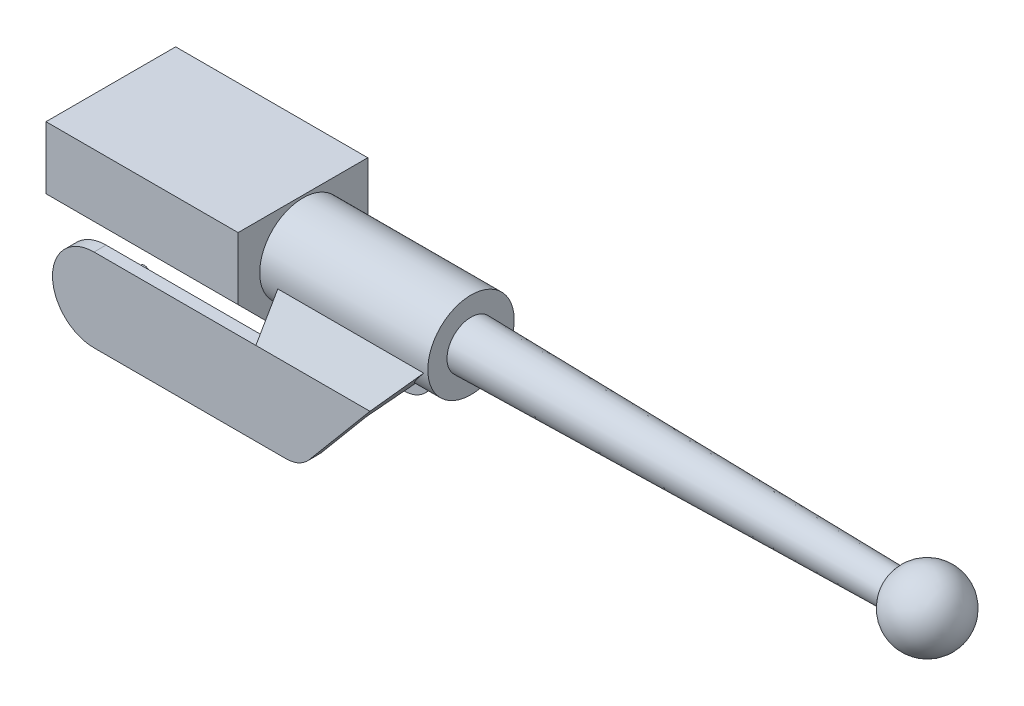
ISO-10303-21;
HEADER;
FILE_DESCRIPTION(('STEP AP214'),'2;1');
FILE_NAME('part.step','',(''),(''),'','','');
FILE_SCHEMA(('AUTOMOTIVE_DESIGN { 1 0 10303 214 1 1 1 1 }'));
ENDSEC;
DATA;
#1=APPLICATION_CONTEXT('core data for automotive mechanical design processes');
#2=APPLICATION_PROTOCOL_DEFINITION('international standard','automotive_design',2000,#1);
#3=PRODUCT_CONTEXT('',#1,'mechanical');
#4=PRODUCT('Part','Part','',(#3));
#5=PRODUCT_RELATED_PRODUCT_CATEGORY('part','',(#4));
#6=PRODUCT_DEFINITION_FORMATION('','',#4);
#7=PRODUCT_DEFINITION_CONTEXT('part definition',#1,'design');
#8=PRODUCT_DEFINITION('design','',#6,#7);
#9=PRODUCT_DEFINITION_SHAPE('','',#8);
#10=(LENGTH_UNIT() NAMED_UNIT(*) SI_UNIT(.MILLI.,.METRE.));
#11=(NAMED_UNIT(*) PLANE_ANGLE_UNIT() SI_UNIT($,.RADIAN.));
#12=(NAMED_UNIT(*) SI_UNIT($,.STERADIAN.) SOLID_ANGLE_UNIT());
#13=UNCERTAINTY_MEASURE_WITH_UNIT(LENGTH_MEASURE(1.E-05),#10,'distance_accuracy_value','');
#14=(GEOMETRIC_REPRESENTATION_CONTEXT(3) GLOBAL_UNCERTAINTY_ASSIGNED_CONTEXT((#13)) GLOBAL_UNIT_ASSIGNED_CONTEXT((#10,
#11,#12)) REPRESENTATION_CONTEXT('',''));
#15=CARTESIAN_POINT('',(0.,0.,0.));
#16=DIRECTION('',(0.,0.,1.));
#17=DIRECTION('',(1.,0.,0.));
#18=AXIS2_PLACEMENT_3D('',#15,#16,#17);
#19=CARTESIAN_POINT('',(-750.,-127.283333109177,110.));
#20=DIRECTION('',(0.,0.,1.));
#21=DIRECTION('',(0.,-1.,0.));
#22=AXIS2_PLACEMENT_3D('',#19,#20,#21);
#23=PLANE('',#22);
#24=CARTESIAN_POINT('',(-250.,-200.,110.));
#25=DIRECTION('',(0.,0.,1.));
#26=DIRECTION('',(0.,-1.,0.));
#27=AXIS2_PLACEMENT_3D('',#24,#25,#26);
#28=CIRCLE('',#27,62.953588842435);
#29=CARTESIAN_POINT('',(-250.,-262.953588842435,110.));
#30=VERTEX_POINT('',#29);
#31=CARTESIAN_POINT('',(-201.774753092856,-240.465786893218,110.));
#32=VERTEX_POINT('',#31);
#33=EDGE_CURVE('E224',#30,#32,#28,.T.);
#34=ORIENTED_EDGE('',*,*,#33,.F.);
#35=DIRECTION('',(-1.,0.,0.));
#36=VECTOR('',#35,1.);
#37=CARTESIAN_POINT('',(-250.,-262.953588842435,110.));
#38=LINE('',#37,#36);
#39=CARTESIAN_POINT('',(-650.,-262.953588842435,110.));
#40=VERTEX_POINT('',#39);
#41=EDGE_CURVE('E212',#30,#40,#38,.T.);
#42=ORIENTED_EDGE('',*,*,#41,.T.);
#43=CARTESIAN_POINT('',(-650.,-176.476794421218,110.));
#44=DIRECTION('',(0.,0.,1.));
#45=DIRECTION('',(0.,-1.,0.));
#46=AXIS2_PLACEMENT_3D('',#43,#44,#45);
#47=CIRCLE('',#46,86.4767944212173);
#48=CARTESIAN_POINT('',(-650.,-90.,110.));
#49=VERTEX_POINT('',#48);
#50=EDGE_CURVE('E366',#40,#49,#47,.F.);
#51=ORIENTED_EDGE('',*,*,#50,.T.);
#52=DIRECTION('',(1.,0.,0.));
#53=VECTOR('',#52,1.);
#54=CARTESIAN_POINT('',(-650.,-90.,110.));
#55=LINE('',#54,#53);
#56=CARTESIAN_POINT('',(-312.953588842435,-90.,110.));
#57=VERTEX_POINT('',#56);
#58=EDGE_CURVE('E195',#49,#57,#55,.T.);
#59=ORIENTED_EDGE('',*,*,#58,.T.);
#60=DIRECTION('',(0.,-1.,0.));
#61=VECTOR('',#60,1.);
#62=CARTESIAN_POINT('',(-312.953588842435,0.,110.));
#63=LINE('',#62,#61);
#64=CARTESIAN_POINT('',(-312.953588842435,-127.283333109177,110.));
#65=VERTEX_POINT('',#64);
#66=EDGE_CURVE('E51',#57,#65,#63,.T.);
#67=ORIENTED_EDGE('',*,*,#66,.T.);
#68=DIRECTION('',(1.,0.,0.));
#69=VECTOR('',#68,1.);
#70=CARTESIAN_POINT('',(-750.,-127.283333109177,110.));
#71=LINE('',#70,#69);
#72=CARTESIAN_POINT('',(-106.803397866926,-127.283333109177,110.));
#73=VERTEX_POINT('',#72);
#74=EDGE_CURVE('E215',#65,#73,#71,.T.);
#75=ORIENTED_EDGE('',*,*,#74,.T.);
#76=DIRECTION('',(0.642787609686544,0.766044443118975,0.));
#77=VECTOR('',#76,1.);
#78=CARTESIAN_POINT('',(-201.774753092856,-240.465786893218,110.));
#79=LINE('',#78,#77);
#80=EDGE_CURVE('E226',#32,#73,#79,.T.);
#81=ORIENTED_EDGE('',*,*,#80,.F.);
#82=EDGE_LOOP('',(#34,#42,#51,#59,#67,#75,#81));
#83=FACE_BOUND('',#82,.T.);
#84=CARTESIAN_POINT('',(-650.,-176.476794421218,110.));
#85=DIRECTION('',(0.,0.,1.));
#86=DIRECTION('',(1.,0.,0.));
#87=AXIS2_PLACEMENT_3D('',#84,#85,#86);
#88=CIRCLE('',#87,10.);
#89=CARTESIAN_POINT('',(-640.,-176.476794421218,110.));
#90=VERTEX_POINT('',#89);
#91=EDGE_CURVE('E372',#90,#90,#88,.T.);
#92=ORIENTED_EDGE('',*,*,#91,.T.);
#93=EDGE_LOOP('',(#92));
#94=FACE_BOUND('',#93,.T.);
#95=CARTESIAN_POINT('',(-250.,-200.,110.));
#96=DIRECTION('',(0.,0.,1.));
#97=DIRECTION('',(0.,-1.,0.));
#98=AXIS2_PLACEMENT_3D('',#95,#96,#97);
#99=CIRCLE('',#98,15.);
#100=CARTESIAN_POINT('',(-250.,-215.,110.));
#101=VERTEX_POINT('',#100);
#102=EDGE_CURVE('E12',#101,#101,#99,.F.);
#103=ORIENTED_EDGE('',*,*,#102,.F.);
#104=EDGE_LOOP('',(#103));
#105=FACE_BOUND('',#104,.T.);
#106=ADVANCED_FACE('F35',(#83,#94,#105),#23,.F.);
#107=CARTESIAN_POINT('',(0.,0.,0.));
#108=DIRECTION('',(1.,0.,0.));
#109=DIRECTION('',(0.,0.,-1.));
#110=AXIS2_PLACEMENT_3D('',#107,#108,#109);
#111=PLANE('',#110);
#112=CARTESIAN_POINT('',(0.,0.,0.));
#113=DIRECTION('',(1.,0.,0.));
#114=DIRECTION('',(0.,0.,-1.));
#115=AXIS2_PLACEMENT_3D('',#112,#113,#114);
#116=CIRCLE('',#115,90.);
#117=CARTESIAN_POINT('',(0.,0.,-90.));
#118=VERTEX_POINT('',#117);
#119=EDGE_CURVE('E310',#118,#118,#116,.T.);
#120=ORIENTED_EDGE('',*,*,#119,.T.);
#121=EDGE_LOOP('',(#120));
#122=FACE_BOUND('',#121,.T.);
#123=CARTESIAN_POINT('',(0.,0.,0.));
#124=DIRECTION('',(1.,0.,0.));
#125=DIRECTION('',(0.,0.,-1.));
#126=AXIS2_PLACEMENT_3D('',#123,#124,#125);
#127=CIRCLE('',#126,50.);
#128=CARTESIAN_POINT('',(0.,0.,-50.));
#129=VERTEX_POINT('',#128);
#130=EDGE_CURVE('E188',#129,#129,#127,.T.);
#131=ORIENTED_EDGE('',*,*,#130,.F.);
#132=EDGE_LOOP('',(#131));
#133=FACE_BOUND('',#132,.T.);
#134=ADVANCED_FACE('F398',(#122,#133),#111,.T.);
#135=CARTESIAN_POINT('',(-350.,0.,0.));
#136=DIRECTION('',(1.,0.,0.));
#137=DIRECTION('',(0.,0.,-1.));
#138=AXIS2_PLACEMENT_3D('',#135,#136,#137);
#139=CYLINDRICAL_SURFACE('',#138,90.);
#140=DIRECTION('',(1.,0.,0.));
#141=VECTOR('',#140,1.);
#142=CARTESIAN_POINT('',(-350.,-10.9084534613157,89.3364743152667));
#143=LINE('',#142,#141);
#144=CARTESIAN_POINT('',(-9.15327927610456,-10.9084534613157,89.3364743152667));
#145=VERTEX_POINT('',#144);
#146=CARTESIAN_POINT('',(-312.953588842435,-10.9084534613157,89.3364743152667));
#147=VERTEX_POINT('',#146);
#148=EDGE_CURVE('E273',#145,#147,#143,.F.);
#149=ORIENTED_EDGE('',*,*,#148,.F.);
#150=CARTESIAN_POINT('',(0.,0.,0.));
#151=DIRECTION('',(-0.766044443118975,0.642787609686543,0.));
#152=DIRECTION('',(0.642787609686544,0.766044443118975,0.));
#153=AXIS2_PLACEMENT_3D('',#150,#151,#152);
#154=ELLIPSE('',#153,117.486656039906,90.);
#155=CARTESIAN_POINT('',(-60.1565780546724,-71.6918180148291,54.4084849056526));
#156=VERTEX_POINT('',#155);
#157=EDGE_CURVE('E280',#145,#156,#154,.F.);
#158=ORIENTED_EDGE('',*,*,#157,.T.);
#159=DIRECTION('',(1.,0.,0.));
#160=VECTOR('',#159,1.);
#161=CARTESIAN_POINT('',(-350.,-71.6918180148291,54.4084849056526));
#162=LINE('',#161,#160);
#163=CARTESIAN_POINT('',(-312.953588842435,-71.6918180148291,54.4084849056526));
#164=VERTEX_POINT('',#163);
#165=EDGE_CURVE('E337',#156,#164,#162,.F.);
#166=ORIENTED_EDGE('',*,*,#165,.T.);
#167=CARTESIAN_POINT('',(-312.953588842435,0.,0.));
#168=DIRECTION('',(1.,0.,0.));
#169=DIRECTION('',(0.,0.,-1.));
#170=AXIS2_PLACEMENT_3D('',#167,#168,#169);
#171=CIRCLE('',#170,90.);
#172=EDGE_CURVE('E44',#164,#147,#171,.F.);
#173=ORIENTED_EDGE('',*,*,#172,.T.);
#174=EDGE_LOOP('',(#149,#158,#166,#173));
#175=FACE_BOUND('',#174,.T.);
#176=DIRECTION('',(1.,0.,0.));
#177=VECTOR('',#176,1.);
#178=CARTESIAN_POINT('',(-350.,-10.9084534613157,-89.3364743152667));
#179=LINE('',#178,#177);
#180=CARTESIAN_POINT('',(-312.953588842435,-10.9084534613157,-89.3364743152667));
#181=VERTEX_POINT('',#180);
#182=CARTESIAN_POINT('',(-9.15327927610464,-10.9084534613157,-89.3364743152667));
#183=VERTEX_POINT('',#182);
#184=EDGE_CURVE('E275',#181,#183,#179,.T.);
#185=ORIENTED_EDGE('',*,*,#184,.F.);
#186=CARTESIAN_POINT('',(-312.953588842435,-74.3017038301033,-50.7863840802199));
#187=VERTEX_POINT('',#186);
#188=EDGE_CURVE('E334',#181,#187,#171,.F.);
#189=ORIENTED_EDGE('',*,*,#188,.T.);
#190=DIRECTION('',(1.,0.,0.));
#191=VECTOR('',#190,1.);
#192=CARTESIAN_POINT('',(-350.,-74.3017038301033,-50.7863840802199));
#193=LINE('',#192,#191);
#194=CARTESIAN_POINT('',(-62.3465322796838,-74.3017038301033,-50.7863840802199));
#195=VERTEX_POINT('',#194);
#196=EDGE_CURVE('E331',#187,#195,#193,.T.);
#197=ORIENTED_EDGE('',*,*,#196,.T.);
#198=EDGE_CURVE('E277',#195,#183,#154,.F.);
#199=ORIENTED_EDGE('',*,*,#198,.T.);
#200=EDGE_LOOP('',(#185,#189,#197,#199));
#201=FACE_BOUND('',#200,.T.);
#202=CARTESIAN_POINT('',(-350.,0.,0.));
#203=DIRECTION('',(1.,0.,0.));
#204=DIRECTION('',(0.,0.,-1.));
#205=AXIS2_PLACEMENT_3D('',#202,#203,#204);
#206=CIRCLE('',#205,90.);
#207=CARTESIAN_POINT('',(-350.,0.,-90.));
#208=VERTEX_POINT('',#207);
#209=EDGE_CURVE('E307',#208,#208,#206,.F.);
#210=ORIENTED_EDGE('',*,*,#209,.F.);
#211=EDGE_LOOP('',(#210));
#212=FACE_BOUND('',#211,.T.);
#213=ORIENTED_EDGE('',*,*,#119,.F.);
#214=EDGE_LOOP('',(#213));
#215=FACE_BOUND('',#214,.T.);
#216=ADVANCED_FACE('F344',(#175,#201,#212,#215),#139,.T.);
#217=CARTESIAN_POINT('',(-750.,-95.,135.));
#218=DIRECTION('',(0.,0.,-1.));
#219=DIRECTION('',(-1.,0.,0.));
#220=AXIS2_PLACEMENT_3D('',#217,#218,#219);
#221=PLANE('',#220);
#222=DIRECTION('',(0.,1.,0.));
#223=VECTOR('',#222,1.);
#224=CARTESIAN_POINT('',(-750.,-95.,135.));
#225=LINE('',#224,#223);
#226=CARTESIAN_POINT('',(-750.,-35.,135.));
#227=VERTEX_POINT('',#226);
#228=CARTESIAN_POINT('',(-750.,95.,135.));
#229=VERTEX_POINT('',#228);
#230=EDGE_CURVE('E281',#227,#229,#225,.T.);
#231=ORIENTED_EDGE('',*,*,#230,.F.);
#232=DIRECTION('',(1.,0.,0.));
#233=VECTOR('',#232,1.);
#234=CARTESIAN_POINT('',(-750.,-35.,135.));
#235=LINE('',#234,#233);
#236=CARTESIAN_POINT('',(-350.,-35.,135.));
#237=VERTEX_POINT('',#236);
#238=EDGE_CURVE('E328',#227,#237,#235,.T.);
#239=ORIENTED_EDGE('',*,*,#238,.T.);
#240=DIRECTION('',(0.,1.,0.));
#241=VECTOR('',#240,1.);
#242=CARTESIAN_POINT('',(-350.,-95.,135.));
#243=LINE('',#242,#241);
#244=CARTESIAN_POINT('',(-350.,95.,135.));
#245=VERTEX_POINT('',#244);
#246=EDGE_CURVE('E293',#237,#245,#243,.T.);
#247=ORIENTED_EDGE('',*,*,#246,.T.);
#248=DIRECTION('',(1.,0.,0.));
#249=VECTOR('',#248,1.);
#250=CARTESIAN_POINT('',(-750.,95.,135.));
#251=LINE('',#250,#249);
#252=EDGE_CURVE('E304',#229,#245,#251,.T.);
#253=ORIENTED_EDGE('',*,*,#252,.F.);
#254=EDGE_LOOP('',(#231,#239,#247,#253));
#255=FACE_BOUND('',#254,.T.);
#256=ADVANCED_FACE('F461',(#255),#221,.F.);
#257=CARTESIAN_POINT('',(-750.,95.,-135.));
#258=DIRECTION('',(0.,-1.,0.));
#259=DIRECTION('',(0.,0.,-1.));
#260=AXIS2_PLACEMENT_3D('',#257,#258,#259);
#261=PLANE('',#260);
#262=DIRECTION('',(0.,0.,-1.));
#263=VECTOR('',#262,1.);
#264=CARTESIAN_POINT('',(-350.,95.,-135.));
#265=LINE('',#264,#263);
#266=CARTESIAN_POINT('',(-350.,95.,-135.));
#267=VERTEX_POINT('',#266);
#268=EDGE_CURVE('E295',#245,#267,#265,.T.);
#269=ORIENTED_EDGE('',*,*,#268,.T.);
#270=DIRECTION('',(1.,0.,0.));
#271=VECTOR('',#270,1.);
#272=CARTESIAN_POINT('',(-750.,95.,-135.));
#273=LINE('',#272,#271);
#274=CARTESIAN_POINT('',(-750.,95.,-135.));
#275=VERTEX_POINT('',#274);
#276=EDGE_CURVE('E292',#275,#267,#273,.T.);
#277=ORIENTED_EDGE('',*,*,#276,.F.);
#278=DIRECTION('',(0.,0.,-1.));
#279=VECTOR('',#278,1.);
#280=CARTESIAN_POINT('',(-750.,95.,-135.));
#281=LINE('',#280,#279);
#282=EDGE_CURVE('E283',#229,#275,#281,.T.);
#283=ORIENTED_EDGE('',*,*,#282,.F.);
#284=ORIENTED_EDGE('',*,*,#252,.T.);
#285=EDGE_LOOP('',(#269,#277,#283,#284));
#286=FACE_BOUND('',#285,.T.);
#287=ADVANCED_FACE('F457',(#286),#261,.F.);
#288=CARTESIAN_POINT('',(-750.,-95.,-135.));
#289=DIRECTION('',(0.,0.,1.));
#290=DIRECTION('',(1.,0.,0.));
#291=AXIS2_PLACEMENT_3D('',#288,#289,#290);
#292=PLANE('',#291);
#293=DIRECTION('',(0.,-1.,0.));
#294=VECTOR('',#293,1.);
#295=CARTESIAN_POINT('',(-350.,-95.,-135.));
#296=LINE('',#295,#294);
#297=CARTESIAN_POINT('',(-350.,-35.,-135.));
#298=VERTEX_POINT('',#297);
#299=EDGE_CURVE('E297',#267,#298,#296,.T.);
#300=ORIENTED_EDGE('',*,*,#299,.T.);
#301=DIRECTION('',(-1.,0.,0.));
#302=VECTOR('',#301,1.);
#303=CARTESIAN_POINT('',(-750.,-35.,-135.));
#304=LINE('',#303,#302);
#305=CARTESIAN_POINT('',(-750.,-35.,-135.));
#306=VERTEX_POINT('',#305);
#307=EDGE_CURVE('E322',#298,#306,#304,.T.);
#308=ORIENTED_EDGE('',*,*,#307,.T.);
#309=DIRECTION('',(0.,-1.,0.));
#310=VECTOR('',#309,1.);
#311=CARTESIAN_POINT('',(-750.,-95.,-135.));
#312=LINE('',#311,#310);
#313=EDGE_CURVE('E286',#275,#306,#312,.T.);
#314=ORIENTED_EDGE('',*,*,#313,.F.);
#315=ORIENTED_EDGE('',*,*,#276,.T.);
#316=EDGE_LOOP('',(#300,#308,#314,#315));
#317=FACE_BOUND('',#316,.T.);
#318=ADVANCED_FACE('F453',(#317),#292,.F.);
#319=CARTESIAN_POINT('',(-750.,-95.,-135.));
#320=DIRECTION('',(0.,1.,0.));
#321=DIRECTION('',(0.,0.,1.));
#322=AXIS2_PLACEMENT_3D('',#319,#320,#321);
#323=PLANE('',#322);
#324=DIRECTION('',(0.,0.,1.));
#325=VECTOR('',#324,1.);
#326=CARTESIAN_POINT('',(-750.,-95.,-135.));
#327=LINE('',#326,#325);
#328=CARTESIAN_POINT('',(-750.,-95.,-75.));
#329=VERTEX_POINT('',#328);
#330=CARTESIAN_POINT('',(-750.,-95.,75.));
#331=VERTEX_POINT('',#330);
#332=EDGE_CURVE('E289',#329,#331,#327,.T.);
#333=ORIENTED_EDGE('',*,*,#332,.F.);
#334=DIRECTION('',(1.,0.,0.));
#335=VECTOR('',#334,1.);
#336=CARTESIAN_POINT('',(-750.,-95.,-75.));
#337=LINE('',#336,#335);
#338=CARTESIAN_POINT('',(-350.,-95.,-75.));
#339=VERTEX_POINT('',#338);
#340=EDGE_CURVE('E315',#329,#339,#337,.T.);
#341=ORIENTED_EDGE('',*,*,#340,.T.);
#342=DIRECTION('',(0.,0.,1.));
#343=VECTOR('',#342,1.);
#344=CARTESIAN_POINT('',(-350.,-95.,-135.));
#345=LINE('',#344,#343);
#346=CARTESIAN_POINT('',(-350.,-95.,75.));
#347=VERTEX_POINT('',#346);
#348=EDGE_CURVE('E284',#339,#347,#345,.T.);
#349=ORIENTED_EDGE('',*,*,#348,.T.);
#350=DIRECTION('',(-1.,0.,0.));
#351=VECTOR('',#350,1.);
#352=CARTESIAN_POINT('',(-750.,-95.,75.));
#353=LINE('',#352,#351);
#354=EDGE_CURVE('E313',#347,#331,#353,.T.);
#355=ORIENTED_EDGE('',*,*,#354,.T.);
#356=EDGE_LOOP('',(#333,#341,#349,#355));
#357=FACE_BOUND('',#356,.T.);
#358=ADVANCED_FACE('F445',(#357),#323,.F.);
#359=CARTESIAN_POINT('',(-750.,95.,135.));
#360=DIRECTION('',(1.,0.,0.));
#361=DIRECTION('',(0.,0.,-1.));
#362=AXIS2_PLACEMENT_3D('',#359,#360,#361);
#363=PLANE('',#362);
#364=ORIENTED_EDGE('',*,*,#313,.T.);
#365=DIRECTION('',(0.,0.707106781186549,-0.707106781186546));
#366=VECTOR('',#365,1.);
#367=CARTESIAN_POINT('',(-750.,-95.,-75.));
#368=LINE('',#367,#366);
#369=EDGE_CURVE('E326',#306,#329,#368,.F.);
#370=ORIENTED_EDGE('',*,*,#369,.T.);
#371=ORIENTED_EDGE('',*,*,#332,.T.);
#372=DIRECTION('',(0.,-0.707106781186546,-0.707106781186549));
#373=VECTOR('',#372,1.);
#374=CARTESIAN_POINT('',(-750.,-35.,135.));
#375=LINE('',#374,#373);
#376=EDGE_CURVE('E324',#331,#227,#375,.F.);
#377=ORIENTED_EDGE('',*,*,#376,.T.);
#378=ORIENTED_EDGE('',*,*,#230,.T.);
#379=ORIENTED_EDGE('',*,*,#282,.T.);
#380=EDGE_LOOP('',(#364,#370,#371,#377,#378,#379));
#381=FACE_BOUND('',#380,.T.);
#382=ADVANCED_FACE('F441',(#381),#363,.F.);
#383=CARTESIAN_POINT('',(-350.,95.,135.));
#384=DIRECTION('',(1.,0.,0.));
#385=DIRECTION('',(0.,0.,-1.));
#386=AXIS2_PLACEMENT_3D('',#383,#384,#385);
#387=PLANE('',#386);
#388=ORIENTED_EDGE('',*,*,#209,.T.);
#389=EDGE_LOOP('',(#388));
#390=FACE_BOUND('',#389,.T.);
#391=ORIENTED_EDGE('',*,*,#348,.F.);
#392=DIRECTION('',(0.,-0.707106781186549,0.707106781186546));
#393=VECTOR('',#392,1.);
#394=CARTESIAN_POINT('',(-350.,-105.,-65.));
#395=LINE('',#394,#393);
#396=EDGE_CURVE('E320',#339,#298,#395,.F.);
#397=ORIENTED_EDGE('',*,*,#396,.T.);
#398=ORIENTED_EDGE('',*,*,#299,.F.);
#399=ORIENTED_EDGE('',*,*,#268,.F.);
#400=ORIENTED_EDGE('',*,*,#246,.F.);
#401=DIRECTION('',(0.,0.707106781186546,0.707106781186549));
#402=VECTOR('',#401,1.);
#403=CARTESIAN_POINT('',(-350.,30.,200.));
#404=LINE('',#403,#402);
#405=EDGE_CURVE('E318',#237,#347,#404,.F.);
#406=ORIENTED_EDGE('',*,*,#405,.T.);
#407=EDGE_LOOP('',(#391,#397,#398,#399,#400,#406));
#408=FACE_BOUND('',#407,.T.);
#409=ADVANCED_FACE('F444',(#390,#408),#387,.T.);
#410=CARTESIAN_POINT('',(-750.,-95.,-75.));
#411=DIRECTION('',(0.,0.707106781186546,0.707106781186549));
#412=DIRECTION('',(0.,-0.707106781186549,0.707106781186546));
#413=AXIS2_PLACEMENT_3D('',#410,#411,#412);
#414=PLANE('',#413);
#415=ORIENTED_EDGE('',*,*,#369,.F.);
#416=ORIENTED_EDGE('',*,*,#307,.F.);
#417=ORIENTED_EDGE('',*,*,#396,.F.);
#418=ORIENTED_EDGE('',*,*,#340,.F.);
#419=EDGE_LOOP('',(#415,#416,#417,#418));
#420=FACE_BOUND('',#419,.T.);
#421=ADVANCED_FACE('F449',(#420),#414,.F.);
#422=CARTESIAN_POINT('',(-750.,-35.,135.));
#423=DIRECTION('',(0.,0.707106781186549,-0.707106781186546));
#424=DIRECTION('',(0.,0.707106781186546,0.707106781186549));
#425=AXIS2_PLACEMENT_3D('',#422,#423,#424);
#426=PLANE('',#425);
#427=ORIENTED_EDGE('',*,*,#376,.F.);
#428=ORIENTED_EDGE('',*,*,#354,.F.);
#429=ORIENTED_EDGE('',*,*,#405,.F.);
#430=ORIENTED_EDGE('',*,*,#238,.F.);
#431=EDGE_LOOP('',(#427,#428,#429,#430));
#432=FACE_BOUND('',#431,.T.);
#433=ADVANCED_FACE('F414',(#432),#426,.F.);
#434=CARTESIAN_POINT('',(-750.,-133.515319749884,-110.));
#435=DIRECTION('',(0.,0.707106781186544,-0.707106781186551));
#436=DIRECTION('',(0.,0.707106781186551,0.707106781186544));
#437=AXIS2_PLACEMENT_3D('',#434,#435,#436);
#438=PLANE('',#437);
#439=ORIENTED_EDGE('',*,*,#196,.F.);
#440=DIRECTION('',(0.,0.707106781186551,0.707106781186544));
#441=VECTOR('',#440,1.);
#442=CARTESIAN_POINT('',(-312.953588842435,55.7423401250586,79.2576598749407));
#443=LINE('',#442,#441);
#444=CARTESIAN_POINT('',(-312.953588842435,-133.515319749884,-110.));
#445=VERTEX_POINT('',#444);
#446=EDGE_CURVE('E265',#445,#187,#443,.T.);
#447=ORIENTED_EDGE('',*,*,#446,.F.);
#448=DIRECTION('',(1.,0.,0.));
#449=VECTOR('',#448,1.);
#450=CARTESIAN_POINT('',(-750.,-133.515319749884,-110.));
#451=LINE('',#450,#449);
#452=CARTESIAN_POINT('',(-112.032655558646,-133.515319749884,-110.));
#453=VERTEX_POINT('',#452);
#454=EDGE_CURVE('E214',#445,#453,#451,.T.);
#455=ORIENTED_EDGE('',*,*,#454,.T.);
#456=DIRECTION('',(-0.510273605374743,-0.608120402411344,-0.608120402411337));
#457=VECTOR('',#456,1.);
#458=CARTESIAN_POINT('',(-92.5617813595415,-110.310835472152,-86.7955157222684));
#459=LINE('',#458,#457);
#460=EDGE_CURVE('E217',#195,#453,#459,.T.);
#461=ORIENTED_EDGE('',*,*,#460,.F.);
#462=EDGE_LOOP('',(#439,#447,#455,#461));
#463=FACE_BOUND('',#462,.T.);
#464=ADVANCED_FACE('F410',(#463),#438,.F.);
#465=CARTESIAN_POINT('',(-750.,-133.515319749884,-110.));
#466=DIRECTION('',(0.,0.,-1.));
#467=DIRECTION('',(0.,1.,0.));
#468=AXIS2_PLACEMENT_3D('',#465,#466,#467);
#469=PLANE('',#468);
#470=CARTESIAN_POINT('',(-250.,-200.,-110.));
#471=DIRECTION('',(0.,0.,-1.));
#472=DIRECTION('',(-1.,0.,0.));
#473=AXIS2_PLACEMENT_3D('',#470,#471,#472);
#474=CIRCLE('',#473,15.);
#475=CARTESIAN_POINT('',(-265.,-200.,-110.));
#476=VERTEX_POINT('',#475);
#477=EDGE_CURVE('E379',#476,#476,#474,.T.);
#478=ORIENTED_EDGE('',*,*,#477,.T.);
#479=EDGE_LOOP('',(#478));
#480=FACE_BOUND('',#479,.T.);
#481=ORIENTED_EDGE('',*,*,#454,.F.);
#482=DIRECTION('',(0.,1.,0.));
#483=VECTOR('',#482,1.);
#484=CARTESIAN_POINT('',(-312.953588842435,0.,-110.));
#485=LINE('',#484,#483);
#486=CARTESIAN_POINT('',(-312.953588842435,-200.,-110.));
#487=VERTEX_POINT('',#486);
#488=EDGE_CURVE('E270',#487,#445,#485,.T.);
#489=ORIENTED_EDGE('',*,*,#488,.F.);
#490=CARTESIAN_POINT('',(-250.,-200.,-110.));
#491=DIRECTION('',(0.,0.,-1.));
#492=DIRECTION('',(0.,1.,0.));
#493=AXIS2_PLACEMENT_3D('',#490,#491,#492);
#494=CIRCLE('',#493,62.953588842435);
#495=CARTESIAN_POINT('',(-201.774753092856,-240.465786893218,-110.));
#496=VERTEX_POINT('',#495);
#497=EDGE_CURVE('E229',#496,#487,#494,.T.);
#498=ORIENTED_EDGE('',*,*,#497,.F.);
#499=DIRECTION('',(-0.642787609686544,-0.766044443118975,0.));
#500=VECTOR('',#499,1.);
#501=CARTESIAN_POINT('',(-201.774753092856,-240.465786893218,-110.));
#502=LINE('',#501,#500);
#503=EDGE_CURVE('E231',#453,#496,#502,.T.);
#504=ORIENTED_EDGE('',*,*,#503,.F.);
#505=EDGE_LOOP('',(#481,#489,#498,#504));
#506=FACE_BOUND('',#505,.T.);
#507=ADVANCED_FACE('F413',(#480,#506),#469,.F.);
#508=CARTESIAN_POINT('',(0.,0.,-83.0384757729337));
#509=DIRECTION('',(0.,-0.5,0.86602540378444));
#510=DIRECTION('',(0.,-0.86602540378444,-0.5));
#511=AXIS2_PLACEMENT_3D('',#508,#509,#510);
#512=PLANE('',#511);
#513=DIRECTION('',(0.,0.86602540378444,0.5));
#514=VECTOR('',#513,1.);
#515=CARTESIAN_POINT('',(-312.953588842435,0.,-83.0384757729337));
#516=LINE('',#515,#514);
#517=CARTESIAN_POINT('',(-312.953588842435,-90.,-135.));
#518=VERTEX_POINT('',#517);
#519=EDGE_CURVE('E255',#181,#518,#516,.F.);
#520=ORIENTED_EDGE('',*,*,#519,.F.);
#521=ORIENTED_EDGE('',*,*,#184,.T.);
#522=DIRECTION('',(-0.58785888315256,-0.700582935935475,-0.404481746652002));
#523=VECTOR('',#522,1.);
#524=CARTESIAN_POINT('',(0.,0.,-83.0384757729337));
#525=LINE('',#524,#523);
#526=CARTESIAN_POINT('',(-75.5189668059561,-90.,-135.));
#527=VERTEX_POINT('',#526);
#528=EDGE_CURVE('E261',#527,#183,#525,.F.);
#529=ORIENTED_EDGE('',*,*,#528,.F.);
#530=DIRECTION('',(1.,0.,0.));
#531=VECTOR('',#530,1.);
#532=CARTESIAN_POINT('',(-250.,-90.,-135.));
#533=LINE('',#532,#531);
#534=EDGE_CURVE('E257',#518,#527,#533,.T.);
#535=ORIENTED_EDGE('',*,*,#534,.F.);
#536=EDGE_LOOP('',(#520,#521,#529,#535));
#537=FACE_BOUND('',#536,.T.);
#538=ADVANCED_FACE('F418',(#537),#512,.F.);
#539=CARTESIAN_POINT('',(-250.,-200.,-135.));
#540=DIRECTION('',(0.,0.,1.));
#541=DIRECTION('',(1.,0.,0.));
#542=AXIS2_PLACEMENT_3D('',#539,#540,#541);
#543=PLANE('',#542);
#544=DIRECTION('',(0.,-1.,0.));
#545=VECTOR('',#544,1.);
#546=CARTESIAN_POINT('',(-312.953588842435,0.,-135.));
#547=LINE('',#546,#545);
#548=CARTESIAN_POINT('',(-312.953588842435,-200.,-135.));
#549=VERTEX_POINT('',#548);
#550=EDGE_CURVE('E237',#518,#549,#547,.T.);
#551=ORIENTED_EDGE('',*,*,#550,.F.);
#552=ORIENTED_EDGE('',*,*,#534,.T.);
#553=DIRECTION('',(0.642787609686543,0.766044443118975,0.));
#554=VECTOR('',#553,1.);
#555=CARTESIAN_POINT('',(-201.774753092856,-240.465786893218,-135.));
#556=LINE('',#555,#554);
#557=CARTESIAN_POINT('',(-201.774753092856,-240.465786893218,-135.));
#558=VERTEX_POINT('',#557);
#559=EDGE_CURVE('E242',#558,#527,#556,.T.);
#560=ORIENTED_EDGE('',*,*,#559,.F.);
#561=CARTESIAN_POINT('',(-250.,-200.,-135.));
#562=DIRECTION('',(0.,0.,1.));
#563=DIRECTION('',(1.,0.,0.));
#564=AXIS2_PLACEMENT_3D('',#561,#562,#563);
#565=CIRCLE('',#564,62.953588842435);
#566=EDGE_CURVE('E234',#549,#558,#565,.T.);
#567=ORIENTED_EDGE('',*,*,#566,.F.);
#568=EDGE_LOOP('',(#551,#552,#560,#567));
#569=FACE_BOUND('',#568,.T.);
#570=ADVANCED_FACE('F422',(#569),#543,.F.);
#571=CARTESIAN_POINT('',(-201.774753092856,-240.465786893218,135.));
#572=DIRECTION('',(-0.766044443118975,0.642787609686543,0.));
#573=DIRECTION('',(-0.642787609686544,-0.766044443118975,0.));
#574=AXIS2_PLACEMENT_3D('',#571,#572,#573);
#575=PLANE('',#574);
#576=ORIENTED_EDGE('',*,*,#198,.F.);
#577=ORIENTED_EDGE('',*,*,#460,.T.);
#578=ORIENTED_EDGE('',*,*,#503,.T.);
#579=DIRECTION('',(0.,0.,-1.));
#580=VECTOR('',#579,1.);
#581=CARTESIAN_POINT('',(-201.774753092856,-240.465786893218,135.));
#582=LINE('',#581,#580);
#583=EDGE_CURVE('E248',#496,#558,#582,.T.);
#584=ORIENTED_EDGE('',*,*,#583,.T.);
#585=ORIENTED_EDGE('',*,*,#559,.T.);
#586=ORIENTED_EDGE('',*,*,#528,.T.);
#587=EDGE_LOOP('',(#576,#577,#578,#584,#585,#586));
#588=FACE_BOUND('',#587,.T.);
#589=ADVANCED_FACE('F425',(#588),#575,.F.);
#590=CARTESIAN_POINT('',(-250.,-200.,135.));
#591=DIRECTION('',(0.,0.,-1.));
#592=DIRECTION('',(-1.,0.,0.));
#593=AXIS2_PLACEMENT_3D('',#590,#591,#592);
#594=CYLINDRICAL_SURFACE('',#593,62.953588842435);
#595=ORIENTED_EDGE('',*,*,#497,.T.);
#596=DIRECTION('',(0.,0.,-1.));
#597=VECTOR('',#596,1.);
#598=CARTESIAN_POINT('',(-312.953588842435,-200.,135.));
#599=LINE('',#598,#597);
#600=EDGE_CURVE('E239',#487,#549,#599,.T.);
#601=ORIENTED_EDGE('',*,*,#600,.T.);
#602=ORIENTED_EDGE('',*,*,#566,.T.);
#603=ORIENTED_EDGE('',*,*,#583,.F.);
#604=EDGE_LOOP('',(#595,#601,#602,#603));
#605=FACE_BOUND('',#604,.T.);
#606=ADVANCED_FACE('F432',(#605),#594,.T.);
#607=CARTESIAN_POINT('',(-312.953588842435,0.,135.));
#608=DIRECTION('',(1.,0.,0.));
#609=DIRECTION('',(0.,0.,-1.));
#610=AXIS2_PLACEMENT_3D('',#607,#608,#609);
#611=PLANE('',#610);
#612=ORIENTED_EDGE('',*,*,#188,.F.);
#613=ORIENTED_EDGE('',*,*,#519,.T.);
#614=ORIENTED_EDGE('',*,*,#550,.T.);
#615=ORIENTED_EDGE('',*,*,#600,.F.);
#616=ORIENTED_EDGE('',*,*,#488,.T.);
#617=ORIENTED_EDGE('',*,*,#446,.T.);
#618=EDGE_LOOP('',(#612,#613,#614,#615,#616,#617));
#619=FACE_BOUND('',#618,.T.);
#620=ADVANCED_FACE('F429',(#619),#611,.F.);
#621=ORIENTED_EDGE('',*,*,#157,.F.);
#622=DIRECTION('',(-0.58785888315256,-0.700582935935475,0.404481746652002));
#623=VECTOR('',#622,1.);
#624=CARTESIAN_POINT('',(-135.815784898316,-161.858949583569,176.487783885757));
#625=LINE('',#624,#623);
#626=CARTESIAN_POINT('',(-75.5189668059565,-90.,135.));
#627=VERTEX_POINT('',#626);
#628=EDGE_CURVE('E259',#145,#627,#625,.T.);
#629=ORIENTED_EDGE('',*,*,#628,.T.);
#630=DIRECTION('',(0.642787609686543,0.766044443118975,0.));
#631=VECTOR('',#630,1.);
#632=CARTESIAN_POINT('',(-201.774753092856,-240.465786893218,135.));
#633=LINE('',#632,#631);
#634=CARTESIAN_POINT('',(-201.774753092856,-240.465786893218,135.));
#635=VERTEX_POINT('',#634);
#636=EDGE_CURVE('E236',#635,#627,#633,.T.);
#637=ORIENTED_EDGE('',*,*,#636,.F.);
#638=EDGE_CURVE('E249',#635,#32,#582,.T.);
#639=ORIENTED_EDGE('',*,*,#638,.T.);
#640=ORIENTED_EDGE('',*,*,#80,.T.);
#641=DIRECTION('',(0.510273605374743,0.608120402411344,-0.608120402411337));
#642=VECTOR('',#641,1.);
#643=CARTESIAN_POINT('',(-174.411050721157,-207.854996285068,190.57166317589));
#644=LINE('',#643,#642);
#645=EDGE_CURVE('E221',#73,#156,#644,.T.);
#646=ORIENTED_EDGE('',*,*,#645,.T.);
#647=EDGE_LOOP('',(#621,#629,#637,#639,#640,#646));
#648=FACE_BOUND('',#647,.T.);
#649=ADVANCED_FACE('F354',(#648),#575,.F.);
#650=CARTESIAN_POINT('',(-250.,-200.,135.));
#651=DIRECTION('',(0.,0.,1.));
#652=DIRECTION('',(1.,0.,0.));
#653=AXIS2_PLACEMENT_3D('',#650,#651,#652);
#654=CIRCLE('',#653,62.953588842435);
#655=CARTESIAN_POINT('',(-250.,-262.953588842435,135.));
#656=VERTEX_POINT('',#655);
#657=EDGE_CURVE('E59',#656,#635,#654,.T.);
#658=ORIENTED_EDGE('',*,*,#657,.F.);
#659=DIRECTION('',(0.,0.,1.));
#660=VECTOR('',#659,1.);
#661=CARTESIAN_POINT('',(-250.,-262.953588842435,-451.97795054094));
#662=LINE('',#661,#660);
#663=EDGE_CURVE('E207',#30,#656,#662,.T.);
#664=ORIENTED_EDGE('',*,*,#663,.F.);
#665=ORIENTED_EDGE('',*,*,#33,.T.);
#666=ORIENTED_EDGE('',*,*,#638,.F.);
#667=EDGE_LOOP('',(#658,#664,#665,#666));
#668=FACE_BOUND('',#667,.T.);
#669=ADVANCED_FACE('F359',(#668),#594,.T.);
#670=ORIENTED_EDGE('',*,*,#66,.F.);
#671=DIRECTION('',(0.,0.,1.));
#672=VECTOR('',#671,1.);
#673=CARTESIAN_POINT('',(-312.953588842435,-90.,135.));
#674=LINE('',#673,#672);
#675=CARTESIAN_POINT('',(-312.953588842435,-90.,135.));
#676=VERTEX_POINT('',#675);
#677=EDGE_CURVE('E211',#57,#676,#674,.T.);
#678=ORIENTED_EDGE('',*,*,#677,.T.);
#679=DIRECTION('',(0.,0.86602540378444,-0.5));
#680=VECTOR('',#679,1.);
#681=CARTESIAN_POINT('',(-312.953588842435,-90.,135.));
#682=LINE('',#681,#680);
#683=EDGE_CURVE('E252',#676,#147,#682,.T.);
#684=ORIENTED_EDGE('',*,*,#683,.T.);
#685=ORIENTED_EDGE('',*,*,#172,.F.);
#686=DIRECTION('',(0.,-0.707106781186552,0.707106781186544));
#687=VECTOR('',#686,1.);
#688=CARTESIAN_POINT('',(-312.953588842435,-76.1416665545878,58.8583334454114));
#689=LINE('',#688,#687);
#690=EDGE_CURVE('E268',#164,#65,#689,.T.);
#691=ORIENTED_EDGE('',*,*,#690,.T.);
#692=EDGE_LOOP('',(#670,#678,#684,#685,#691));
#693=FACE_BOUND('',#692,.T.);
#694=ADVANCED_FACE('F346',(#693),#611,.F.);
#695=CARTESIAN_POINT('',(-250.,-200.,135.));
#696=DIRECTION('',(0.,0.,1.));
#697=DIRECTION('',(1.,0.,0.));
#698=AXIS2_PLACEMENT_3D('',#695,#696,#697);
#699=PLANE('',#698);
#700=DIRECTION('',(1.,0.,0.));
#701=VECTOR('',#700,1.);
#702=CARTESIAN_POINT('',(-250.,-262.953588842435,135.));
#703=LINE('',#702,#701);
#704=CARTESIAN_POINT('',(-650.,-262.953588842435,135.));
#705=VERTEX_POINT('',#704);
#706=EDGE_CURVE('E199',#705,#656,#703,.T.);
#707=ORIENTED_EDGE('',*,*,#706,.T.);
#708=ORIENTED_EDGE('',*,*,#657,.T.);
#709=ORIENTED_EDGE('',*,*,#636,.T.);
#710=DIRECTION('',(-1.,0.,0.));
#711=VECTOR('',#710,1.);
#712=CARTESIAN_POINT('',(-312.953588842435,-90.,135.));
#713=LINE('',#712,#711);
#714=EDGE_CURVE('E186',#627,#676,#713,.T.);
#715=ORIENTED_EDGE('',*,*,#714,.T.);
#716=DIRECTION('',(-1.,0.,0.));
#717=VECTOR('',#716,1.);
#718=CARTESIAN_POINT('',(-650.,-90.,135.));
#719=LINE('',#718,#717);
#720=CARTESIAN_POINT('',(-650.,-90.,135.));
#721=VERTEX_POINT('',#720);
#722=EDGE_CURVE('E177',#676,#721,#719,.T.);
#723=ORIENTED_EDGE('',*,*,#722,.T.);
#724=CARTESIAN_POINT('',(-650.,-176.476794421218,135.));
#725=DIRECTION('',(0.,0.,1.));
#726=DIRECTION('',(1.,0.,0.));
#727=AXIS2_PLACEMENT_3D('',#724,#725,#726);
#728=CIRCLE('',#727,86.4767944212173);
#729=EDGE_CURVE('E182',#721,#705,#728,.T.);
#730=ORIENTED_EDGE('',*,*,#729,.T.);
#731=EDGE_LOOP('',(#707,#708,#709,#715,#723,#730));
#732=FACE_BOUND('',#731,.T.);
#733=ADVANCED_FACE('F180',(#732),#699,.T.);
#734=CARTESIAN_POINT('',(-250.,-90.,135.));
#735=DIRECTION('',(0.,0.5,0.86602540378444));
#736=DIRECTION('',(0.,-0.86602540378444,0.5));
#737=AXIS2_PLACEMENT_3D('',#734,#735,#736);
#738=PLANE('',#737);
#739=ORIENTED_EDGE('',*,*,#628,.F.);
#740=ORIENTED_EDGE('',*,*,#148,.T.);
#741=ORIENTED_EDGE('',*,*,#683,.F.);
#742=ORIENTED_EDGE('',*,*,#714,.F.);
#743=EDGE_LOOP('',(#739,#740,#741,#742));
#744=FACE_BOUND('',#743,.T.);
#745=ADVANCED_FACE('F351',(#744),#738,.T.);
#746=CARTESIAN_POINT('',(-750.,-127.283333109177,110.));
#747=DIRECTION('',(0.,0.707106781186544,0.707106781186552));
#748=DIRECTION('',(0.,-0.707106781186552,0.707106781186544));
#749=AXIS2_PLACEMENT_3D('',#746,#747,#748);
#750=PLANE('',#749);
#751=ORIENTED_EDGE('',*,*,#165,.F.);
#752=ORIENTED_EDGE('',*,*,#645,.F.);
#753=ORIENTED_EDGE('',*,*,#74,.F.);
#754=ORIENTED_EDGE('',*,*,#690,.F.);
#755=EDGE_LOOP('',(#751,#752,#753,#754));
#756=FACE_BOUND('',#755,.T.);
#757=ADVANCED_FACE('F365',(#756),#750,.F.);
#758=CARTESIAN_POINT('',(-650.,-90.,-451.97795054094));
#759=DIRECTION('',(0.,1.,0.));
#760=DIRECTION('',(-1.,0.,0.));
#761=AXIS2_PLACEMENT_3D('',#758,#759,#760);
#762=PLANE('',#761);
#763=ORIENTED_EDGE('',*,*,#677,.F.);
#764=ORIENTED_EDGE('',*,*,#58,.F.);
#765=DIRECTION('',(0.,0.,1.));
#766=VECTOR('',#765,1.);
#767=CARTESIAN_POINT('',(-650.,-90.,-451.97795054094));
#768=LINE('',#767,#766);
#769=EDGE_CURVE('E192',#49,#721,#768,.T.);
#770=ORIENTED_EDGE('',*,*,#769,.T.);
#771=ORIENTED_EDGE('',*,*,#722,.F.);
#772=EDGE_LOOP('',(#763,#764,#770,#771));
#773=FACE_BOUND('',#772,.T.);
#774=ADVANCED_FACE('F193',(#773),#762,.T.);
#775=CARTESIAN_POINT('',(-250.,-262.953588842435,-451.97795054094));
#776=DIRECTION('',(0.,-1.,0.));
#777=DIRECTION('',(1.,0.,0.));
#778=AXIS2_PLACEMENT_3D('',#775,#776,#777);
#779=PLANE('',#778);
#780=ORIENTED_EDGE('',*,*,#41,.F.);
#781=ORIENTED_EDGE('',*,*,#663,.T.);
#782=ORIENTED_EDGE('',*,*,#706,.F.);
#783=DIRECTION('',(0.,0.,1.));
#784=VECTOR('',#783,1.);
#785=CARTESIAN_POINT('',(-650.,-262.953588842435,-451.97795054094));
#786=LINE('',#785,#784);
#787=EDGE_CURVE('E198',#40,#705,#786,.T.);
#788=ORIENTED_EDGE('',*,*,#787,.F.);
#789=EDGE_LOOP('',(#780,#781,#782,#788));
#790=FACE_BOUND('',#789,.T.);
#791=ADVANCED_FACE('F357',(#790),#779,.T.);
#792=CARTESIAN_POINT('',(-650.,-176.476794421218,-451.97795054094));
#793=DIRECTION('',(0.,0.,1.));
#794=DIRECTION('',(1.,0.,0.));
#795=AXIS2_PLACEMENT_3D('',#792,#793,#794);
#796=CYLINDRICAL_SURFACE('',#795,86.4767944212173);
#797=ORIENTED_EDGE('',*,*,#50,.F.);
#798=ORIENTED_EDGE('',*,*,#787,.T.);
#799=ORIENTED_EDGE('',*,*,#729,.F.);
#800=ORIENTED_EDGE('',*,*,#769,.F.);
#801=EDGE_LOOP('',(#797,#798,#799,#800));
#802=FACE_BOUND('',#801,.T.);
#803=ADVANCED_FACE('F201',(#802),#796,.T.);
#804=CARTESIAN_POINT('',(0.,0.,0.));
#805=DIRECTION('',(-1.,0.,0.));
#806=DIRECTION('',(0.,0.,-1.));
#807=AXIS2_PLACEMENT_3D('',#804,#805,#806);
#808=CONICAL_SURFACE('',#807,50.,0.0174532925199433);
#809=CARTESIAN_POINT('',(883.447260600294,0.,0.));
#810=DIRECTION('',(1.,0.,0.));
#811=DIRECTION('',(0.,0.,-1.));
#812=AXIS2_PLACEMENT_3D('',#809,#810,#811);
#813=CIRCLE('',#812,34.5793707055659);
#814=CARTESIAN_POINT('',(883.447260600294,0.,-34.5793707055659));
#815=VERTEX_POINT('',#814);
#816=EDGE_CURVE('E39',#815,#815,#813,.F.);
#817=ORIENTED_EDGE('',*,*,#816,.T.);
#818=EDGE_LOOP('',(#817));
#819=FACE_BOUND('',#818,.T.);
#820=ORIENTED_EDGE('',*,*,#130,.T.);
#821=EDGE_LOOP('',(#820));
#822=FACE_BOUND('',#821,.T.);
#823=ADVANCED_FACE('F571',(#819,#822),#808,.T.);
#824=CARTESIAN_POINT('',(950.,0.,0.));
#825=DIRECTION('',(1.,0.,0.));
#826=DIRECTION('',(0.,-1.,0.));
#827=AXIS2_PLACEMENT_3D('',#824,#825,#826);
#828=SPHERICAL_SURFACE('',#827,75.);
#829=ORIENTED_EDGE('',*,*,#816,.F.);
#830=EDGE_LOOP('',(#829));
#831=FACE_BOUND('',#830,.T.);
#832=ADVANCED_FACE('F37',(#831),#828,.T.);
#833=CARTESIAN_POINT('',(-650.,-176.476794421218,30.));
#834=DIRECTION('',(0.,0.,1.));
#835=DIRECTION('',(1.,0.,0.));
#836=AXIS2_PLACEMENT_3D('',#833,#834,#835);
#837=CYLINDRICAL_SURFACE('',#836,10.);
#838=CARTESIAN_POINT('',(-650.,-176.476794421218,30.));
#839=DIRECTION('',(0.,0.,1.));
#840=DIRECTION('',(1.,0.,0.));
#841=AXIS2_PLACEMENT_3D('',#838,#839,#840);
#842=CIRCLE('',#841,10.);
#843=CARTESIAN_POINT('',(-640.,-176.476794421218,30.));
#844=VERTEX_POINT('',#843);
#845=EDGE_CURVE('E375',#844,#844,#842,.T.);
#846=ORIENTED_EDGE('',*,*,#845,.T.);
#847=EDGE_LOOP('',(#846));
#848=FACE_BOUND('',#847,.T.);
#849=ORIENTED_EDGE('',*,*,#91,.F.);
#850=EDGE_LOOP('',(#849));
#851=FACE_BOUND('',#850,.T.);
#852=ADVANCED_FACE('F584',(#848,#851),#837,.T.);
#853=CARTESIAN_POINT('',(-650.,-176.476794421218,30.));
#854=DIRECTION('',(0.,0.,1.));
#855=DIRECTION('',(1.,0.,0.));
#856=AXIS2_PLACEMENT_3D('',#853,#854,#855);
#857=PLANE('',#856);
#858=ORIENTED_EDGE('',*,*,#845,.F.);
#859=EDGE_LOOP('',(#858));
#860=FACE_BOUND('',#859,.T.);
#861=ADVANCED_FACE('F590',(#860),#857,.F.);
#862=CARTESIAN_POINT('',(-250.,-200.,-60.));
#863=DIRECTION('',(0.,0.,-1.));
#864=DIRECTION('',(-1.,0.,0.));
#865=AXIS2_PLACEMENT_3D('',#862,#863,#864);
#866=CYLINDRICAL_SURFACE('',#865,15.);
#867=CARTESIAN_POINT('',(-250.,-200.,-60.));
#868=DIRECTION('',(0.,0.,-1.));
#869=DIRECTION('',(-1.,0.,0.));
#870=AXIS2_PLACEMENT_3D('',#867,#868,#869);
#871=CIRCLE('',#870,15.);
#872=CARTESIAN_POINT('',(-265.,-200.,-60.));
#873=VERTEX_POINT('',#872);
#874=EDGE_CURVE('E376',#873,#873,#871,.T.);
#875=ORIENTED_EDGE('',*,*,#874,.T.);
#876=EDGE_LOOP('',(#875));
#877=FACE_BOUND('',#876,.T.);
#878=ORIENTED_EDGE('',*,*,#477,.F.);
#879=EDGE_LOOP('',(#878));
#880=FACE_BOUND('',#879,.T.);
#881=ADVANCED_FACE('F598',(#877,#880),#866,.T.);
#882=CARTESIAN_POINT('',(-250.,-200.,-60.));
#883=DIRECTION('',(0.,0.,-1.));
#884=DIRECTION('',(-1.,0.,0.));
#885=AXIS2_PLACEMENT_3D('',#882,#883,#884);
#886=PLANE('',#885);
#887=ORIENTED_EDGE('',*,*,#874,.F.);
#888=EDGE_LOOP('',(#887));
#889=FACE_BOUND('',#888,.T.);
#890=ADVANCED_FACE('F393',(#889),#886,.F.);
#891=CARTESIAN_POINT('',(-250.,-200.,60.));
#892=DIRECTION('',(0.,0.,1.));
#893=DIRECTION('',(0.,-1.,0.));
#894=AXIS2_PLACEMENT_3D('',#891,#892,#893);
#895=CYLINDRICAL_SURFACE('',#894,15.);
#896=CARTESIAN_POINT('',(-250.,-200.,60.));
#897=DIRECTION('',(0.,0.,-1.));
#898=DIRECTION('',(0.,1.,0.));
#899=AXIS2_PLACEMENT_3D('',#896,#897,#898);
#900=CIRCLE('',#899,15.);
#901=CARTESIAN_POINT('',(-250.,-185.,60.));
#902=VERTEX_POINT('',#901);
#903=EDGE_CURVE('E382',#902,#902,#900,.T.);
#904=ORIENTED_EDGE('',*,*,#903,.F.);
#905=EDGE_LOOP('',(#904));
#906=FACE_BOUND('',#905,.T.);
#907=ORIENTED_EDGE('',*,*,#102,.T.);
#908=EDGE_LOOP('',(#907));
#909=FACE_BOUND('',#908,.T.);
#910=ADVANCED_FACE('F390',(#906,#909),#895,.T.);
#911=CARTESIAN_POINT('',(-250.,-200.,60.));
#912=DIRECTION('',(0.,0.,-1.));
#913=DIRECTION('',(0.,1.,0.));
#914=AXIS2_PLACEMENT_3D('',#911,#912,#913);
#915=PLANE('',#914);
#916=ORIENTED_EDGE('',*,*,#903,.T.);
#917=EDGE_LOOP('',(#916));
#918=FACE_BOUND('',#917,.T.);
#919=ADVANCED_FACE('F388',(#918),#915,.T.);
#920=CLOSED_SHELL('',(#106,#134,#216,#256,#287,#318,#358,#382,#409,#421,#433,#464,#507,#538,
#570,#589,#606,#620,#649,#669,#694,#733,#745,#757,#774,#791,#803,#823,#832,#852,#861,#881,#890,
#910,#919));
#921=MANIFOLD_SOLID_BREP('B2',#920);
#922=ADVANCED_BREP_SHAPE_REPRESENTATION('',(#18,#921),#14);
#923=SHAPE_DEFINITION_REPRESENTATION(#9,#922);
ENDSEC;
END-ISO-10303-21;
